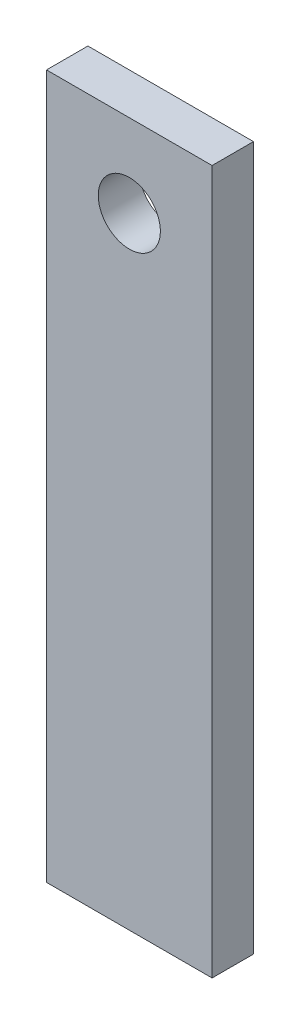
from build123d import *

# Parameters (mm, degrees)
SKETCH1_W           = 76.2
SKETCH1_H           = 323.85
SKETCH1_R           = 14.2875
BOSS_EXTRUDE1_DEPTH = 9.525


with BuildPart() as part:
    # Sketch1 → Boss-Extrude1 (new, symmetric)
    with BuildSketch(Plane.XY):
        with Locations((0, -123.825)):
            Rectangle(SKETCH1_W, SKETCH1_H)
        with Locations(Location((0, 0, 0), (0, 0, 180))):
            Circle(SKETCH1_R, mode=Mode.SUBTRACT)
    extrude(amount=BOSS_EXTRUDE1_DEPTH, both=True)


solid = part.part
